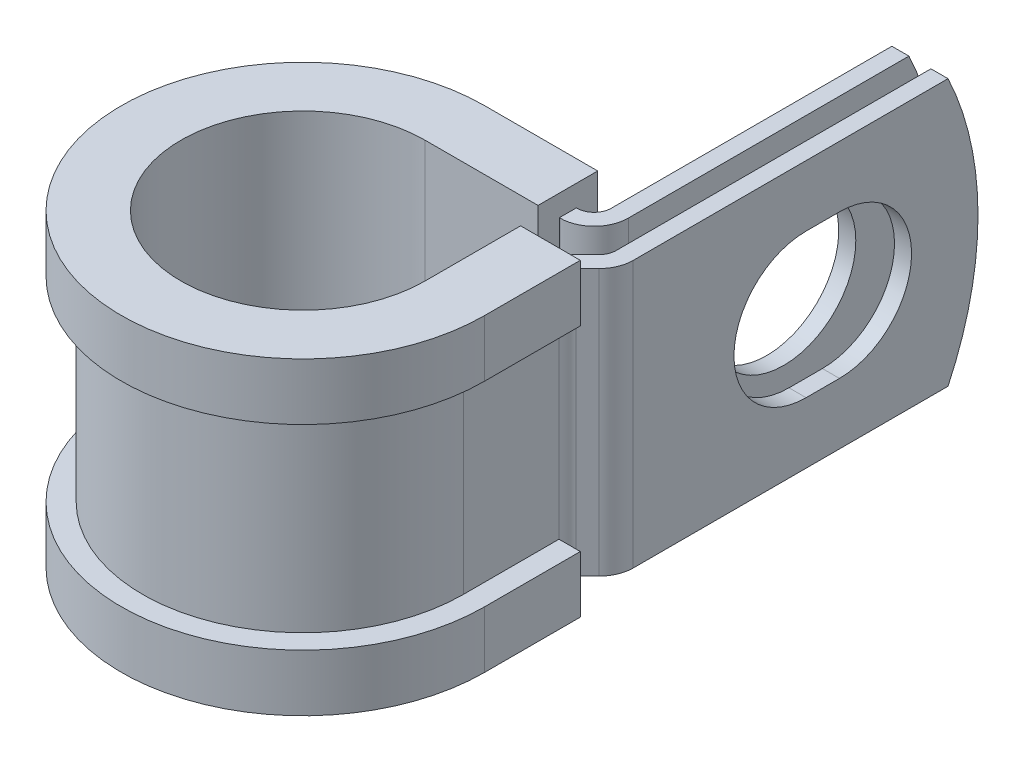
ISO-10303-21;
HEADER;
FILE_DESCRIPTION(('STEP AP214'),'2;1');
FILE_NAME('part.step','',(''),(''),'','','');
FILE_SCHEMA(('AUTOMOTIVE_DESIGN { 1 0 10303 214 1 1 1 1 }'));
ENDSEC;
DATA;
#1=APPLICATION_CONTEXT('core data for automotive mechanical design processes');
#2=APPLICATION_PROTOCOL_DEFINITION('international standard','automotive_design',2000,#1);
#3=PRODUCT_CONTEXT('',#1,'mechanical');
#4=PRODUCT('Part','Part','',(#3));
#5=PRODUCT_RELATED_PRODUCT_CATEGORY('part','',(#4));
#6=PRODUCT_DEFINITION_FORMATION('','',#4);
#7=PRODUCT_DEFINITION_CONTEXT('part definition',#1,'design');
#8=PRODUCT_DEFINITION('design','',#6,#7);
#9=PRODUCT_DEFINITION_SHAPE('','',#8);
#10=(LENGTH_UNIT() NAMED_UNIT(*) SI_UNIT(.MILLI.,.METRE.));
#11=(NAMED_UNIT(*) PLANE_ANGLE_UNIT() SI_UNIT($,.RADIAN.));
#12=(NAMED_UNIT(*) SI_UNIT($,.STERADIAN.) SOLID_ANGLE_UNIT());
#13=UNCERTAINTY_MEASURE_WITH_UNIT(LENGTH_MEASURE(1.E-05),#10,'distance_accuracy_value','');
#14=(GEOMETRIC_REPRESENTATION_CONTEXT(3) GLOBAL_UNCERTAINTY_ASSIGNED_CONTEXT((#13)) GLOBAL_UNIT_ASSIGNED_CONTEXT((#10,
#11,#12)) REPRESENTATION_CONTEXT('',''));
#15=CARTESIAN_POINT('',(0.,0.,0.));
#16=DIRECTION('',(0.,0.,1.));
#17=DIRECTION('',(1.,0.,0.));
#18=AXIS2_PLACEMENT_3D('',#15,#16,#17);
#19=CARTESIAN_POINT('',(10.9271698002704,-9.525,-10.2489));
#20=DIRECTION('',(0.,1.,0.));
#21=DIRECTION('',(1.,0.,0.));
#22=AXIS2_PLACEMENT_3D('',#19,#20,#21);
#23=PLANE('',#22);
#24=DIRECTION('',(0.,0.,-1.));
#25=VECTOR('',#24,1.);
#26=CARTESIAN_POINT('',(8.08236980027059,-9.525,-10.2489));
#27=LINE('',#26,#25);
#28=CARTESIAN_POINT('',(8.08236980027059,-9.525,-10.2489));
#29=VERTEX_POINT('',#28);
#30=CARTESIAN_POINT('',(8.08236980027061,-9.525,-11.4681));
#31=VERTEX_POINT('',#30);
#32=EDGE_CURVE('E524',#29,#31,#27,.T.);
#33=ORIENTED_EDGE('',*,*,#32,.T.);
#34=DIRECTION('',(1.,0.,0.));
#35=VECTOR('',#34,1.);
#36=CARTESIAN_POINT('',(0.,-9.525,-11.4681));
#37=LINE('',#36,#35);
#38=CARTESIAN_POINT('',(8.13316980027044,-9.525,-11.4681));
#39=VERTEX_POINT('',#38);
#40=EDGE_CURVE('E411',#39,#31,#37,.F.);
#41=ORIENTED_EDGE('',*,*,#40,.F.);
#42=CARTESIAN_POINT('',(8.13316980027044,-9.525,-12.6873));
#43=DIRECTION('',(0.,1.,0.));
#44=DIRECTION('',(1.,0.,0.));
#45=AXIS2_PLACEMENT_3D('',#42,#43,#44);
#46=CIRCLE('',#45,1.2192);
#47=CARTESIAN_POINT('',(9.35236980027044,-9.525,-12.6873));
#48=VERTEX_POINT('',#47);
#49=EDGE_CURVE('E409',#48,#39,#46,.F.);
#50=ORIENTED_EDGE('',*,*,#49,.F.);
#51=DIRECTION('',(0.,0.,1.));
#52=VECTOR('',#51,1.);
#53=CARTESIAN_POINT('',(9.35236980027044,-9.525,-34.8996));
#54=LINE('',#53,#52);
#55=CARTESIAN_POINT('',(9.35236980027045,-9.525,-32.7550631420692));
#56=VERTEX_POINT('',#55);
#57=EDGE_CURVE('E407',#56,#48,#54,.T.);
#58=ORIENTED_EDGE('',*,*,#57,.F.);
#59=DIRECTION('',(-1.,0.,0.));
#60=VECTOR('',#59,1.);
#61=CARTESIAN_POINT('',(13.3655698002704,-9.525,-32.7550631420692));
#62=LINE('',#61,#60);
#63=CARTESIAN_POINT('',(10.5715698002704,-9.525,-32.7550631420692));
#64=VERTEX_POINT('',#63);
#65=EDGE_CURVE('E12',#64,#56,#62,.T.);
#66=ORIENTED_EDGE('',*,*,#65,.F.);
#67=DIRECTION('',(0.,0.,1.));
#68=VECTOR('',#67,1.);
#69=CARTESIAN_POINT('',(10.5715698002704,-9.525,-34.8996));
#70=LINE('',#69,#68);
#71=CARTESIAN_POINT('',(10.5715698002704,-9.525,-12.6873));
#72=VERTEX_POINT('',#71);
#73=EDGE_CURVE('E405',#64,#72,#70,.T.);
#74=ORIENTED_EDGE('',*,*,#73,.T.);
#75=CARTESIAN_POINT('',(8.13316980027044,-9.525,-12.6873));
#76=DIRECTION('',(0.,-1.,0.));
#77=DIRECTION('',(0.,0.,1.));
#78=AXIS2_PLACEMENT_3D('',#75,#76,#77);
#79=CIRCLE('',#78,2.4384);
#80=CARTESIAN_POINT('',(8.13316980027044,-9.525,-10.2489));
#81=VERTEX_POINT('',#80);
#82=EDGE_CURVE('E402',#72,#81,#79,.T.);
#83=ORIENTED_EDGE('',*,*,#82,.T.);
#84=DIRECTION('',(-1.,0.,0.));
#85=VECTOR('',#84,1.);
#86=CARTESIAN_POINT('',(0.,-9.525,-10.2489));
#87=LINE('',#86,#85);
#88=EDGE_CURVE('E399',#81,#29,#87,.T.);
#89=ORIENTED_EDGE('',*,*,#88,.T.);
#90=EDGE_LOOP('',(#33,#41,#50,#58,#66,#74,#83,#89));
#91=FACE_BOUND('',#90,.T.);
#92=ADVANCED_FACE('F55',(#91),#23,.F.);
#93=CARTESIAN_POINT('',(10.9271698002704,9.525,-10.2489));
#94=DIRECTION('',(0.,1.,0.));
#95=DIRECTION('',(1.,0.,0.));
#96=AXIS2_PLACEMENT_3D('',#93,#94,#95);
#97=PLANE('',#96);
#98=DIRECTION('',(1.,0.,0.));
#99=VECTOR('',#98,1.);
#100=CARTESIAN_POINT('',(0.,9.525,-11.4681));
#101=LINE('',#100,#99);
#102=CARTESIAN_POINT('',(8.13316980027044,9.525,-11.4681));
#103=VERTEX_POINT('',#102);
#104=CARTESIAN_POINT('',(8.08236980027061,9.525,-11.4681));
#105=VERTEX_POINT('',#104);
#106=EDGE_CURVE('E369',#103,#105,#101,.F.);
#107=ORIENTED_EDGE('',*,*,#106,.T.);
#108=DIRECTION('',(0.,0.,1.));
#109=VECTOR('',#108,1.);
#110=CARTESIAN_POINT('',(8.08236980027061,9.525,-11.4681));
#111=LINE('',#110,#109);
#112=CARTESIAN_POINT('',(8.08236980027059,9.525,-10.2489));
#113=VERTEX_POINT('',#112);
#114=EDGE_CURVE('E518',#105,#113,#111,.T.);
#115=ORIENTED_EDGE('',*,*,#114,.T.);
#116=DIRECTION('',(-1.,0.,0.));
#117=VECTOR('',#116,1.);
#118=CARTESIAN_POINT('',(0.,9.525,-10.2489));
#119=LINE('',#118,#117);
#120=CARTESIAN_POINT('',(8.13316980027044,9.525,-10.2489));
#121=VERTEX_POINT('',#120);
#122=EDGE_CURVE('E626',#121,#113,#119,.T.);
#123=ORIENTED_EDGE('',*,*,#122,.F.);
#124=CARTESIAN_POINT('',(8.13316980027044,9.525,-12.6873));
#125=DIRECTION('',(0.,-1.,0.));
#126=DIRECTION('',(0.,0.,1.));
#127=AXIS2_PLACEMENT_3D('',#124,#125,#126);
#128=CIRCLE('',#127,2.4384);
#129=CARTESIAN_POINT('',(10.5715698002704,9.525,-12.6873));
#130=VERTEX_POINT('',#129);
#131=EDGE_CURVE('E371',#130,#121,#128,.T.);
#132=ORIENTED_EDGE('',*,*,#131,.F.);
#133=DIRECTION('',(0.,0.,1.));
#134=VECTOR('',#133,1.);
#135=CARTESIAN_POINT('',(10.5715698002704,9.525,-34.8996));
#136=LINE('',#135,#134);
#137=CARTESIAN_POINT('',(10.5715698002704,9.525,-32.7550631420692));
#138=VERTEX_POINT('',#137);
#139=EDGE_CURVE('E362',#138,#130,#136,.T.);
#140=ORIENTED_EDGE('',*,*,#139,.F.);
#141=DIRECTION('',(-1.,0.,0.));
#142=VECTOR('',#141,1.);
#143=CARTESIAN_POINT('',(13.3655698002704,9.525,-32.7550631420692));
#144=LINE('',#143,#142);
#145=CARTESIAN_POINT('',(9.35236980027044,9.525,-32.7550631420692));
#146=VERTEX_POINT('',#145);
#147=EDGE_CURVE('E63',#138,#146,#144,.T.);
#148=ORIENTED_EDGE('',*,*,#147,.T.);
#149=DIRECTION('',(0.,0.,1.));
#150=VECTOR('',#149,1.);
#151=CARTESIAN_POINT('',(9.35236980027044,9.525,-34.8996));
#152=LINE('',#151,#150);
#153=CARTESIAN_POINT('',(9.35236980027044,9.525,-12.6873));
#154=VERTEX_POINT('',#153);
#155=EDGE_CURVE('E359',#146,#154,#152,.T.);
#156=ORIENTED_EDGE('',*,*,#155,.T.);
#157=CARTESIAN_POINT('',(8.13316980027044,9.525,-12.6873));
#158=DIRECTION('',(0.,1.,0.));
#159=DIRECTION('',(1.,0.,0.));
#160=AXIS2_PLACEMENT_3D('',#157,#158,#159);
#161=CIRCLE('',#160,1.2192);
#162=EDGE_CURVE('E367',#154,#103,#161,.F.);
#163=ORIENTED_EDGE('',*,*,#162,.T.);
#164=EDGE_LOOP('',(#107,#115,#123,#132,#140,#148,#156,#163));
#165=FACE_BOUND('',#164,.T.);
#166=ADVANCED_FACE('F358',(#165),#97,.T.);
#167=CARTESIAN_POINT('',(0.,9.525,-10.2489));
#168=DIRECTION('',(0.,0.,1.));
#169=DIRECTION('',(1.,0.,0.));
#170=AXIS2_PLACEMENT_3D('',#167,#168,#169);
#171=PLANE('',#170);
#172=ORIENTED_EDGE('',*,*,#122,.T.);
#173=DIRECTION('',(0.,-1.,0.));
#174=VECTOR('',#173,1.);
#175=CARTESIAN_POINT('',(8.08236980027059,9.525,-10.2489));
#176=LINE('',#175,#174);
#177=EDGE_CURVE('E521',#113,#29,#176,.T.);
#178=ORIENTED_EDGE('',*,*,#177,.T.);
#179=ORIENTED_EDGE('',*,*,#88,.F.);
#180=DIRECTION('',(0.,-1.,0.));
#181=VECTOR('',#180,1.);
#182=CARTESIAN_POINT('',(8.13316980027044,9.525,-10.2489));
#183=LINE('',#182,#181);
#184=EDGE_CURVE('E345',#121,#81,#183,.T.);
#185=ORIENTED_EDGE('',*,*,#184,.F.);
#186=EDGE_LOOP('',(#172,#178,#179,#185));
#187=FACE_BOUND('',#186,.T.);
#188=ADVANCED_FACE('F636',(#187),#171,.T.);
#189=CARTESIAN_POINT('',(13.3655698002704,9.525,-10.2489));
#190=DIRECTION('',(-1.,0.,0.));
#191=DIRECTION('',(0.,0.,1.));
#192=AXIS2_PLACEMENT_3D('',#189,#190,#191);
#193=PLANE('',#192);
#194=CARTESIAN_POINT('',(13.3655698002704,0.,-24.9935999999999));
#195=DIRECTION('',(1.,0.,0.));
#196=DIRECTION('',(0.,0.,-1.));
#197=AXIS2_PLACEMENT_3D('',#194,#195,#196);
#198=CIRCLE('',#197,5.1562);
#199=CARTESIAN_POINT('',(13.3655698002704,-5.1562,-24.9936000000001));
#200=VERTEX_POINT('',#199);
#201=CARTESIAN_POINT('',(13.3655698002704,5.1562,-24.9936000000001));
#202=VERTEX_POINT('',#201);
#203=EDGE_CURVE('E581',#200,#202,#198,.T.);
#204=ORIENTED_EDGE('',*,*,#203,.F.);
#205=DIRECTION('',(0.,0.,-1.));
#206=VECTOR('',#205,1.);
#207=CARTESIAN_POINT('',(13.3655698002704,-5.1562,-22.6059999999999));
#208=LINE('',#207,#206);
#209=CARTESIAN_POINT('',(13.3655698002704,-5.1562,-22.6059999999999));
#210=VERTEX_POINT('',#209);
#211=EDGE_CURVE('E584',#210,#200,#208,.T.);
#212=ORIENTED_EDGE('',*,*,#211,.F.);
#213=CARTESIAN_POINT('',(13.3655698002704,0.,-22.6059999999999));
#214=DIRECTION('',(1.,0.,0.));
#215=DIRECTION('',(0.,0.,-1.));
#216=AXIS2_PLACEMENT_3D('',#213,#214,#215);
#217=CIRCLE('',#216,5.1562);
#218=CARTESIAN_POINT('',(13.3655698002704,5.1562,-22.6059999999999));
#219=VERTEX_POINT('',#218);
#220=EDGE_CURVE('E577',#219,#210,#217,.T.);
#221=ORIENTED_EDGE('',*,*,#220,.F.);
#222=DIRECTION('',(0.,0.,1.));
#223=VECTOR('',#222,1.);
#224=CARTESIAN_POINT('',(13.3655698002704,5.1562,-22.6059999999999));
#225=LINE('',#224,#223);
#226=EDGE_CURVE('E578',#202,#219,#225,.T.);
#227=ORIENTED_EDGE('',*,*,#226,.F.);
#228=EDGE_LOOP('',(#204,#212,#221,#227));
#229=FACE_BOUND('',#228,.T.);
#230=DIRECTION('',(0.,0.,-1.));
#231=VECTOR('',#230,1.);
#232=CARTESIAN_POINT('',(13.3655698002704,-9.525,-10.2489));
#233=LINE('',#232,#231);
#234=CARTESIAN_POINT('',(13.3655698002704,-9.525,-10.2489));
#235=VERTEX_POINT('',#234);
#236=CARTESIAN_POINT('',(13.3655698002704,-9.525,-32.7550631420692));
#237=VERTEX_POINT('',#236);
#238=EDGE_CURVE('E383',#235,#237,#233,.T.);
#239=ORIENTED_EDGE('',*,*,#238,.T.);
#240=CARTESIAN_POINT('',(13.3655698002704,0.,-12.6746));
#241=DIRECTION('',(-1.,0.,0.));
#242=DIRECTION('',(0.,0.,1.));
#243=AXIS2_PLACEMENT_3D('',#240,#241,#242);
#244=CIRCLE('',#243,22.225);
#245=CARTESIAN_POINT('',(13.3655698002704,9.525,-32.7550631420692));
#246=VERTEX_POINT('',#245);
#247=EDGE_CURVE('E569',#246,#237,#244,.T.);
#248=ORIENTED_EDGE('',*,*,#247,.F.);
#249=DIRECTION('',(0.,0.,-1.));
#250=VECTOR('',#249,1.);
#251=CARTESIAN_POINT('',(13.3655698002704,9.525,-10.2489));
#252=LINE('',#251,#250);
#253=CARTESIAN_POINT('',(13.3655698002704,9.525,-10.2489));
#254=VERTEX_POINT('',#253);
#255=EDGE_CURVE('E420',#254,#246,#252,.T.);
#256=ORIENTED_EDGE('',*,*,#255,.F.);
#257=DIRECTION('',(0.,-1.,0.));
#258=VECTOR('',#257,1.);
#259=CARTESIAN_POINT('',(13.3655698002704,9.525,-10.2489));
#260=LINE('',#259,#258);
#261=EDGE_CURVE('E382',#254,#235,#260,.T.);
#262=ORIENTED_EDGE('',*,*,#261,.T.);
#263=EDGE_LOOP('',(#239,#248,#256,#262));
#264=FACE_BOUND('',#263,.T.);
#265=ADVANCED_FACE('F57',(#229,#264),#193,.F.);
#266=CARTESIAN_POINT('',(12.1463698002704,9.525,-10.2489));
#267=DIRECTION('',(-1.,0.,0.));
#268=DIRECTION('',(0.,0.,1.));
#269=AXIS2_PLACEMENT_3D('',#266,#267,#268);
#270=PLANE('',#269);
#271=DIRECTION('',(0.,0.,-1.));
#272=VECTOR('',#271,1.);
#273=CARTESIAN_POINT('',(12.1463698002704,-5.1562,-22.6059999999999));
#274=LINE('',#273,#272);
#275=CARTESIAN_POINT('',(12.1463698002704,-5.1562,-22.6059999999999));
#276=VERTEX_POINT('',#275);
#277=CARTESIAN_POINT('',(12.1463698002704,-5.1562,-24.9936000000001));
#278=VERTEX_POINT('',#277);
#279=EDGE_CURVE('E580',#276,#278,#274,.T.);
#280=ORIENTED_EDGE('',*,*,#279,.T.);
#281=CARTESIAN_POINT('',(12.1463698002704,0.,-24.9935999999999));
#282=DIRECTION('',(-1.,0.,0.));
#283=DIRECTION('',(0.,0.,1.));
#284=AXIS2_PLACEMENT_3D('',#281,#282,#283);
#285=CIRCLE('',#284,5.1562);
#286=CARTESIAN_POINT('',(12.1463698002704,5.1562,-24.9936000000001));
#287=VERTEX_POINT('',#286);
#288=EDGE_CURVE('E601',#278,#287,#285,.F.);
#289=ORIENTED_EDGE('',*,*,#288,.T.);
#290=DIRECTION('',(0.,0.,1.));
#291=VECTOR('',#290,1.);
#292=CARTESIAN_POINT('',(12.1463698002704,5.1562,-22.6059999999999));
#293=LINE('',#292,#291);
#294=CARTESIAN_POINT('',(12.1463698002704,5.1562,-22.6059999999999));
#295=VERTEX_POINT('',#294);
#296=EDGE_CURVE('E597',#287,#295,#293,.T.);
#297=ORIENTED_EDGE('',*,*,#296,.T.);
#298=CARTESIAN_POINT('',(12.1463698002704,0.,-22.6059999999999));
#299=DIRECTION('',(-1.,0.,0.));
#300=DIRECTION('',(0.,0.,1.));
#301=AXIS2_PLACEMENT_3D('',#298,#299,#300);
#302=CIRCLE('',#301,5.1562);
#303=EDGE_CURVE('E592',#295,#276,#302,.F.);
#304=ORIENTED_EDGE('',*,*,#303,.T.);
#305=EDGE_LOOP('',(#280,#289,#297,#304));
#306=FACE_BOUND('',#305,.T.);
#307=CARTESIAN_POINT('',(12.1463698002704,0.,-12.6746));
#308=DIRECTION('',(-1.,0.,0.));
#309=DIRECTION('',(0.,0.,1.));
#310=AXIS2_PLACEMENT_3D('',#307,#308,#309);
#311=CIRCLE('',#310,22.225);
#312=CARTESIAN_POINT('',(12.1463698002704,9.525,-32.7550631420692));
#313=VERTEX_POINT('',#312);
#314=CARTESIAN_POINT('',(12.1463698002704,-9.525,-32.7550631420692));
#315=VERTEX_POINT('',#314);
#316=EDGE_CURVE('E77',#313,#315,#311,.T.);
#317=ORIENTED_EDGE('',*,*,#316,.T.);
#318=DIRECTION('',(0.,0.,-1.));
#319=VECTOR('',#318,1.);
#320=CARTESIAN_POINT('',(12.1463698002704,-9.525,-10.2489));
#321=LINE('',#320,#319);
#322=CARTESIAN_POINT('',(12.1463698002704,-9.525,-10.2489));
#323=VERTEX_POINT('',#322);
#324=EDGE_CURVE('E386',#323,#315,#321,.T.);
#325=ORIENTED_EDGE('',*,*,#324,.F.);
#326=DIRECTION('',(0.,-1.,0.));
#327=VECTOR('',#326,1.);
#328=CARTESIAN_POINT('',(12.1463698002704,9.525,-10.2489));
#329=LINE('',#328,#327);
#330=CARTESIAN_POINT('',(12.1463698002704,9.525,-10.2489));
#331=VERTEX_POINT('',#330);
#332=EDGE_CURVE('E353',#331,#323,#329,.T.);
#333=ORIENTED_EDGE('',*,*,#332,.F.);
#334=DIRECTION('',(0.,0.,-1.));
#335=VECTOR('',#334,1.);
#336=CARTESIAN_POINT('',(12.1463698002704,9.525,-10.2489));
#337=LINE('',#336,#335);
#338=EDGE_CURVE('E616',#331,#313,#337,.T.);
#339=ORIENTED_EDGE('',*,*,#338,.T.);
#340=EDGE_LOOP('',(#317,#325,#333,#339));
#341=FACE_BOUND('',#340,.T.);
#342=ADVANCED_FACE('F690',(#306,#341),#270,.T.);
#343=CARTESIAN_POINT('',(10.5715698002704,9.525,-34.8996));
#344=DIRECTION('',(1.,0.,0.));
#345=DIRECTION('',(0.,0.,-1.));
#346=AXIS2_PLACEMENT_3D('',#343,#344,#345);
#347=PLANE('',#346);
#348=CARTESIAN_POINT('',(10.5715698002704,0.,-23.7998));
#349=DIRECTION('',(1.,0.,0.));
#350=DIRECTION('',(0.,0.,-1.));
#351=AXIS2_PLACEMENT_3D('',#348,#349,#350);
#352=CIRCLE('',#351,5.1562);
#353=CARTESIAN_POINT('',(10.5715698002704,0.,-28.956));
#354=VERTEX_POINT('',#353);
#355=EDGE_CURVE('E387',#354,#354,#352,.F.);
#356=ORIENTED_EDGE('',*,*,#355,.T.);
#357=EDGE_LOOP('',(#356));
#358=FACE_BOUND('',#357,.T.);
#359=ORIENTED_EDGE('',*,*,#73,.F.);
#360=CARTESIAN_POINT('',(10.5715698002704,0.,-12.6746));
#361=DIRECTION('',(1.,0.,0.));
#362=DIRECTION('',(0.,0.,-1.));
#363=AXIS2_PLACEMENT_3D('',#360,#361,#362);
#364=CIRCLE('',#363,22.225);
#365=EDGE_CURVE('E574',#64,#138,#364,.T.);
#366=ORIENTED_EDGE('',*,*,#365,.T.);
#367=ORIENTED_EDGE('',*,*,#139,.T.);
#368=DIRECTION('',(0.,-1.,0.));
#369=VECTOR('',#368,1.);
#370=CARTESIAN_POINT('',(10.5715698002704,9.525,-12.6873));
#371=LINE('',#370,#369);
#372=EDGE_CURVE('E342',#130,#72,#371,.T.);
#373=ORIENTED_EDGE('',*,*,#372,.T.);
#374=EDGE_LOOP('',(#359,#366,#367,#373));
#375=FACE_BOUND('',#374,.T.);
#376=ADVANCED_FACE('F642',(#358,#375),#347,.T.);
#377=CARTESIAN_POINT('',(9.35236980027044,9.525,-34.8996));
#378=DIRECTION('',(1.,0.,0.));
#379=DIRECTION('',(0.,0.,-1.));
#380=AXIS2_PLACEMENT_3D('',#377,#378,#379);
#381=PLANE('',#380);
#382=CARTESIAN_POINT('',(9.35236980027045,0.,-23.7998));
#383=DIRECTION('',(-1.,0.,0.));
#384=DIRECTION('',(0.,0.,1.));
#385=AXIS2_PLACEMENT_3D('',#382,#383,#384);
#386=CIRCLE('',#385,5.1562);
#387=CARTESIAN_POINT('',(9.35236980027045,0.,-18.6436));
#388=VERTEX_POINT('',#387);
#389=EDGE_CURVE('E609',#388,#388,#386,.T.);
#390=ORIENTED_EDGE('',*,*,#389,.F.);
#391=EDGE_LOOP('',(#390));
#392=FACE_BOUND('',#391,.T.);
#393=CARTESIAN_POINT('',(9.35236980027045,0.,-12.6746));
#394=DIRECTION('',(-1.,0.,0.));
#395=DIRECTION('',(0.,0.,1.));
#396=AXIS2_PLACEMENT_3D('',#393,#394,#395);
#397=CIRCLE('',#396,22.225);
#398=EDGE_CURVE('E69',#146,#56,#397,.T.);
#399=ORIENTED_EDGE('',*,*,#398,.T.);
#400=ORIENTED_EDGE('',*,*,#57,.T.);
#401=DIRECTION('',(0.,-1.,0.));
#402=VECTOR('',#401,1.);
#403=CARTESIAN_POINT('',(9.35236980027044,9.525,-12.6873));
#404=LINE('',#403,#402);
#405=EDGE_CURVE('E339',#154,#48,#404,.T.);
#406=ORIENTED_EDGE('',*,*,#405,.F.);
#407=ORIENTED_EDGE('',*,*,#155,.F.);
#408=EDGE_LOOP('',(#399,#400,#406,#407));
#409=FACE_BOUND('',#408,.T.);
#410=ADVANCED_FACE('F365',(#392,#409),#381,.F.);
#411=CARTESIAN_POINT('',(12.6873,-9.525,-6.83640267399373));
#412=DIRECTION('',(0.,1.,0.));
#413=DIRECTION('',(1.,0.,0.));
#414=AXIS2_PLACEMENT_3D('',#411,#412,#413);
#415=CIRCLE('',#414,1.2192);
#416=CARTESIAN_POINT('',(11.4681,-9.525,-6.83640267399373));
#417=VERTEX_POINT('',#416);
#418=CARTESIAN_POINT('',(11.8251954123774,-9.525,-7.69850726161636));
#419=VERTEX_POINT('',#418);
#420=EDGE_CURVE('E414',#417,#419,#415,.F.);
#421=ORIENTED_EDGE('',*,*,#420,.F.);
#422=DIRECTION('',(1.,0.,0.));
#423=VECTOR('',#422,1.);
#424=CARTESIAN_POINT('',(10.2489,-9.525,-6.83640267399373));
#425=LINE('',#424,#423);
#426=CARTESIAN_POINT('',(10.2489,-9.525,-6.83640267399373));
#427=VERTEX_POINT('',#426);
#428=EDGE_CURVE('E452',#427,#417,#425,.T.);
#429=ORIENTED_EDGE('',*,*,#428,.F.);
#430=CARTESIAN_POINT('',(12.6873,-9.525,-6.83640267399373));
#431=DIRECTION('',(0.,-1.,0.));
#432=DIRECTION('',(0.,0.,1.));
#433=AXIS2_PLACEMENT_3D('',#430,#431,#432);
#434=CIRCLE('',#433,2.4384);
#435=CARTESIAN_POINT('',(10.9630908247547,-9.525,-8.560611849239));
#436=VERTEX_POINT('',#435);
#437=EDGE_CURVE('E396',#427,#436,#434,.T.);
#438=ORIENTED_EDGE('',*,*,#437,.T.);
#439=DIRECTION('',(0.707106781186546,0.,-0.707106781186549));
#440=VECTOR('',#439,1.);
#441=CARTESIAN_POINT('',(10.9630908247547,-9.525,-8.560611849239));
#442=LINE('',#441,#440);
#443=CARTESIAN_POINT('',(11.7892743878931,-9.525,-9.38679541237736));
#444=VERTEX_POINT('',#443);
#445=EDGE_CURVE('E393',#436,#444,#442,.T.);
#446=ORIENTED_EDGE('',*,*,#445,.T.);
#447=CARTESIAN_POINT('',(10.9271698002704,-9.525,-10.2489));
#448=DIRECTION('',(0.,1.,0.));
#449=DIRECTION('',(0.,0.,1.));
#450=AXIS2_PLACEMENT_3D('',#447,#448,#449);
#451=CIRCLE('',#450,1.2192);
#452=EDGE_CURVE('E390',#444,#323,#451,.T.);
#453=ORIENTED_EDGE('',*,*,#452,.T.);
#454=ORIENTED_EDGE('',*,*,#324,.T.);
#455=DIRECTION('',(-1.,0.,0.));
#456=VECTOR('',#455,1.);
#457=CARTESIAN_POINT('',(13.3655698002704,-9.525,-32.7550631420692));
#458=LINE('',#457,#456);
#459=EDGE_CURVE('E567',#237,#315,#458,.T.);
#460=ORIENTED_EDGE('',*,*,#459,.F.);
#461=ORIENTED_EDGE('',*,*,#238,.F.);
#462=CARTESIAN_POINT('',(10.9271698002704,-9.525,-10.2489));
#463=DIRECTION('',(0.,1.,0.));
#464=DIRECTION('',(1.,0.,0.));
#465=AXIS2_PLACEMENT_3D('',#462,#463,#464);
#466=CIRCLE('',#465,2.4384);
#467=CARTESIAN_POINT('',(12.6513789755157,-9.525,-8.52469082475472));
#468=VERTEX_POINT('',#467);
#469=EDGE_CURVE('E418',#468,#235,#466,.T.);
#470=ORIENTED_EDGE('',*,*,#469,.F.);
#471=DIRECTION('',(0.707106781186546,0.,-0.707106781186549));
#472=VECTOR('',#471,1.);
#473=CARTESIAN_POINT('',(11.8251954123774,-9.525,-7.69850726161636));
#474=LINE('',#473,#472);
#475=EDGE_CURVE('E416',#419,#468,#474,.T.);
#476=ORIENTED_EDGE('',*,*,#475,.F.);
#477=EDGE_LOOP('',(#421,#429,#438,#446,#453,#454,#460,#461,#470,#476));
#478=FACE_BOUND('',#477,.T.);
#479=ADVANCED_FACE('F676',(#478),#23,.F.);
#480=DIRECTION('',(-1.,0.,0.));
#481=VECTOR('',#480,1.);
#482=CARTESIAN_POINT('',(11.4681,9.525,-6.83640267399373));
#483=LINE('',#482,#481);
#484=CARTESIAN_POINT('',(11.4681,9.525,-6.83640267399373));
#485=VERTEX_POINT('',#484);
#486=CARTESIAN_POINT('',(10.2489,9.525,-6.83640267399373));
#487=VERTEX_POINT('',#486);
#488=EDGE_CURVE('E441',#485,#487,#483,.T.);
#489=ORIENTED_EDGE('',*,*,#488,.F.);
#490=CARTESIAN_POINT('',(12.6873,9.525,-6.83640267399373));
#491=DIRECTION('',(0.,1.,0.));
#492=DIRECTION('',(1.,0.,0.));
#493=AXIS2_PLACEMENT_3D('',#490,#491,#492);
#494=CIRCLE('',#493,1.2192);
#495=CARTESIAN_POINT('',(11.8251954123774,9.525,-7.69850726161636));
#496=VERTEX_POINT('',#495);
#497=EDGE_CURVE('E376',#485,#496,#494,.F.);
#498=ORIENTED_EDGE('',*,*,#497,.T.);
#499=DIRECTION('',(0.707106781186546,0.,-0.707106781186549));
#500=VECTOR('',#499,1.);
#501=CARTESIAN_POINT('',(11.8251954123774,9.525,-7.69850726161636));
#502=LINE('',#501,#500);
#503=CARTESIAN_POINT('',(12.6513789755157,9.525,-8.52469082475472));
#504=VERTEX_POINT('',#503);
#505=EDGE_CURVE('E378',#496,#504,#502,.T.);
#506=ORIENTED_EDGE('',*,*,#505,.T.);
#507=CARTESIAN_POINT('',(10.9271698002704,9.525,-10.2489));
#508=DIRECTION('',(0.,1.,0.));
#509=DIRECTION('',(1.,0.,0.));
#510=AXIS2_PLACEMENT_3D('',#507,#508,#509);
#511=CIRCLE('',#510,2.4384);
#512=EDGE_CURVE('E380',#504,#254,#511,.T.);
#513=ORIENTED_EDGE('',*,*,#512,.T.);
#514=ORIENTED_EDGE('',*,*,#255,.T.);
#515=DIRECTION('',(-1.,0.,0.));
#516=VECTOR('',#515,1.);
#517=CARTESIAN_POINT('',(13.3655698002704,9.525,-32.7550631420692));
#518=LINE('',#517,#516);
#519=EDGE_CURVE('E571',#246,#313,#518,.T.);
#520=ORIENTED_EDGE('',*,*,#519,.T.);
#521=ORIENTED_EDGE('',*,*,#338,.F.);
#522=CARTESIAN_POINT('',(10.9271698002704,9.525,-10.2489));
#523=DIRECTION('',(0.,1.,0.));
#524=DIRECTION('',(0.,0.,1.));
#525=AXIS2_PLACEMENT_3D('',#522,#523,#524);
#526=CIRCLE('',#525,1.2192);
#527=CARTESIAN_POINT('',(11.7892743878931,9.525,-9.38679541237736));
#528=VERTEX_POINT('',#527);
#529=EDGE_CURVE('E619',#528,#331,#526,.T.);
#530=ORIENTED_EDGE('',*,*,#529,.F.);
#531=DIRECTION('',(0.707106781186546,0.,-0.707106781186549));
#532=VECTOR('',#531,1.);
#533=CARTESIAN_POINT('',(10.9630908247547,9.525,-8.560611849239));
#534=LINE('',#533,#532);
#535=CARTESIAN_POINT('',(10.9630908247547,9.525,-8.560611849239));
#536=VERTEX_POINT('',#535);
#537=EDGE_CURVE('E622',#536,#528,#534,.T.);
#538=ORIENTED_EDGE('',*,*,#537,.F.);
#539=CARTESIAN_POINT('',(12.6873,9.525,-6.83640267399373));
#540=DIRECTION('',(0.,-1.,0.));
#541=DIRECTION('',(0.,0.,1.));
#542=AXIS2_PLACEMENT_3D('',#539,#540,#541);
#543=CIRCLE('',#542,2.4384);
#544=EDGE_CURVE('E451',#487,#536,#543,.T.);
#545=ORIENTED_EDGE('',*,*,#544,.F.);
#546=EDGE_LOOP('',(#489,#498,#506,#513,#514,#520,#521,#530,#538,#545));
#547=FACE_BOUND('',#546,.T.);
#548=ADVANCED_FACE('F448',(#547),#97,.T.);
#549=CARTESIAN_POINT('',(10.9271698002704,9.525,-10.2489));
#550=DIRECTION('',(0.,-1.,0.));
#551=DIRECTION('',(0.,0.,-1.));
#552=AXIS2_PLACEMENT_3D('',#549,#550,#551);
#553=CYLINDRICAL_SURFACE('',#552,1.2192);
#554=ORIENTED_EDGE('',*,*,#452,.F.);
#555=DIRECTION('',(0.,-1.,0.));
#556=VECTOR('',#555,1.);
#557=CARTESIAN_POINT('',(11.7892743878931,9.525,-9.38679541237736));
#558=LINE('',#557,#556);
#559=EDGE_CURVE('E351',#528,#444,#558,.T.);
#560=ORIENTED_EDGE('',*,*,#559,.F.);
#561=ORIENTED_EDGE('',*,*,#529,.T.);
#562=ORIENTED_EDGE('',*,*,#332,.T.);
#563=EDGE_LOOP('',(#554,#560,#561,#562));
#564=FACE_BOUND('',#563,.T.);
#565=ADVANCED_FACE('F686',(#564),#553,.F.);
#566=CARTESIAN_POINT('',(10.9630908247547,9.525,-8.560611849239));
#567=DIRECTION('',(-0.707106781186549,0.,-0.707106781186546));
#568=DIRECTION('',(-0.707106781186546,0.,0.707106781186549));
#569=AXIS2_PLACEMENT_3D('',#566,#567,#568);
#570=PLANE('',#569);
#571=ORIENTED_EDGE('',*,*,#445,.F.);
#572=DIRECTION('',(0.,-1.,0.));
#573=VECTOR('',#572,1.);
#574=CARTESIAN_POINT('',(10.9630908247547,9.525,-8.560611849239));
#575=LINE('',#574,#573);
#576=EDGE_CURVE('E349',#536,#436,#575,.T.);
#577=ORIENTED_EDGE('',*,*,#576,.F.);
#578=ORIENTED_EDGE('',*,*,#537,.T.);
#579=ORIENTED_EDGE('',*,*,#559,.T.);
#580=EDGE_LOOP('',(#571,#577,#578,#579));
#581=FACE_BOUND('',#580,.T.);
#582=ADVANCED_FACE('F681',(#581),#570,.T.);
#583=CARTESIAN_POINT('',(12.6873,9.525,-6.83640267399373));
#584=DIRECTION('',(0.,-1.,0.));
#585=DIRECTION('',(0.,0.,-1.));
#586=AXIS2_PLACEMENT_3D('',#583,#584,#585);
#587=CYLINDRICAL_SURFACE('',#586,2.4384);
#588=ORIENTED_EDGE('',*,*,#437,.F.);
#589=DIRECTION('',(0.,-1.,0.));
#590=VECTOR('',#589,1.);
#591=CARTESIAN_POINT('',(10.2489,9.525,-6.83640267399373));
#592=LINE('',#591,#590);
#593=EDGE_CURVE('E347',#487,#427,#592,.T.);
#594=ORIENTED_EDGE('',*,*,#593,.F.);
#595=ORIENTED_EDGE('',*,*,#544,.T.);
#596=ORIENTED_EDGE('',*,*,#576,.T.);
#597=EDGE_LOOP('',(#588,#594,#595,#596));
#598=FACE_BOUND('',#597,.T.);
#599=ADVANCED_FACE('F678',(#598),#587,.T.);
#600=CARTESIAN_POINT('',(8.13316980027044,9.525,-12.6873));
#601=DIRECTION('',(0.,-1.,0.));
#602=DIRECTION('',(0.,0.,-1.));
#603=AXIS2_PLACEMENT_3D('',#600,#601,#602);
#604=CYLINDRICAL_SURFACE('',#603,2.4384);
#605=ORIENTED_EDGE('',*,*,#82,.F.);
#606=ORIENTED_EDGE('',*,*,#372,.F.);
#607=ORIENTED_EDGE('',*,*,#131,.T.);
#608=ORIENTED_EDGE('',*,*,#184,.T.);
#609=EDGE_LOOP('',(#605,#606,#607,#608));
#610=FACE_BOUND('',#609,.T.);
#611=ADVANCED_FACE('F632',(#610),#604,.T.);
#612=CARTESIAN_POINT('',(8.13316980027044,9.525,-12.6873));
#613=DIRECTION('',(0.,-1.,0.));
#614=DIRECTION('',(0.,0.,-1.));
#615=AXIS2_PLACEMENT_3D('',#612,#613,#614);
#616=CYLINDRICAL_SURFACE('',#615,1.2192);
#617=ORIENTED_EDGE('',*,*,#49,.T.);
#618=DIRECTION('',(0.,-1.,0.));
#619=VECTOR('',#618,1.);
#620=CARTESIAN_POINT('',(8.13316980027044,9.525,-11.4681));
#621=LINE('',#620,#619);
#622=EDGE_CURVE('E330',#103,#39,#621,.T.);
#623=ORIENTED_EDGE('',*,*,#622,.F.);
#624=ORIENTED_EDGE('',*,*,#162,.F.);
#625=ORIENTED_EDGE('',*,*,#405,.T.);
#626=EDGE_LOOP('',(#617,#623,#624,#625));
#627=FACE_BOUND('',#626,.T.);
#628=ADVANCED_FACE('F647',(#627),#616,.F.);
#629=CARTESIAN_POINT('',(0.,9.525,-11.4681));
#630=DIRECTION('',(0.,0.,1.));
#631=DIRECTION('',(1.,0.,0.));
#632=AXIS2_PLACEMENT_3D('',#629,#630,#631);
#633=PLANE('',#632);
#634=DIRECTION('',(0.,-1.,0.));
#635=VECTOR('',#634,1.);
#636=CARTESIAN_POINT('',(0.,9.525,-11.4681));
#637=LINE('',#636,#635);
#638=CARTESIAN_POINT('',(1.60864847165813E-13,6.985,-11.4681));
#639=VERTEX_POINT('',#638);
#640=CARTESIAN_POINT('',(1.60864847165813E-13,-6.985,-11.4681));
#641=VERTEX_POINT('',#640);
#642=EDGE_CURVE('E321',#639,#641,#637,.T.);
#643=ORIENTED_EDGE('',*,*,#642,.F.);
#644=DIRECTION('',(1.,0.,0.));
#645=VECTOR('',#644,1.);
#646=CARTESIAN_POINT('',(1.60864847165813E-13,6.985,-11.4681));
#647=LINE('',#646,#645);
#648=CARTESIAN_POINT('',(8.08236980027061,6.985,-11.4681));
#649=VERTEX_POINT('',#648);
#650=EDGE_CURVE('E564',#639,#649,#647,.T.);
#651=ORIENTED_EDGE('',*,*,#650,.T.);
#652=DIRECTION('',(0.,1.,0.));
#653=VECTOR('',#652,1.);
#654=CARTESIAN_POINT('',(8.08236980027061,9.525,-11.4681));
#655=LINE('',#654,#653);
#656=EDGE_CURVE('E515',#649,#105,#655,.T.);
#657=ORIENTED_EDGE('',*,*,#656,.T.);
#658=ORIENTED_EDGE('',*,*,#106,.F.);
#659=ORIENTED_EDGE('',*,*,#622,.T.);
#660=ORIENTED_EDGE('',*,*,#40,.T.);
#661=DIRECTION('',(0.,1.,0.));
#662=VECTOR('',#661,1.);
#663=CARTESIAN_POINT('',(8.08236980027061,-9.525,-11.4681));
#664=LINE('',#663,#662);
#665=CARTESIAN_POINT('',(8.08236980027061,-6.985,-11.4681));
#666=VERTEX_POINT('',#665);
#667=EDGE_CURVE('E527',#31,#666,#664,.T.);
#668=ORIENTED_EDGE('',*,*,#667,.T.);
#669=DIRECTION('',(1.,0.,0.));
#670=VECTOR('',#669,1.);
#671=CARTESIAN_POINT('',(1.60864847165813E-13,-6.985,-11.4681));
#672=LINE('',#671,#670);
#673=EDGE_CURVE('E544',#641,#666,#672,.T.);
#674=ORIENTED_EDGE('',*,*,#673,.F.);
#675=EDGE_LOOP('',(#643,#651,#657,#658,#659,#660,#668,#674));
#676=FACE_BOUND('',#675,.T.);
#677=ADVANCED_FACE('F651',(#676),#633,.F.);
#678=CARTESIAN_POINT('',(0.,9.525,0.));
#679=DIRECTION('',(0.,-1.,0.));
#680=DIRECTION('',(0.,0.,-1.));
#681=AXIS2_PLACEMENT_3D('',#678,#679,#680);
#682=CYLINDRICAL_SURFACE('',#681,11.4681);
#683=DIRECTION('',(0.,-1.,0.));
#684=VECTOR('',#683,1.);
#685=CARTESIAN_POINT('',(11.4681,9.525,0.));
#686=LINE('',#685,#684);
#687=CARTESIAN_POINT('',(11.4681,6.985,0.));
#688=VERTEX_POINT('',#687);
#689=CARTESIAN_POINT('',(11.4681,-6.985,0.));
#690=VERTEX_POINT('',#689);
#691=EDGE_CURVE('E319',#688,#690,#686,.T.);
#692=ORIENTED_EDGE('',*,*,#691,.F.);
#693=CARTESIAN_POINT('',(0.,6.985,0.));
#694=DIRECTION('',(0.,-1.,0.));
#695=DIRECTION('',(0.,0.,-1.));
#696=AXIS2_PLACEMENT_3D('',#693,#694,#695);
#697=CIRCLE('',#696,11.4681);
#698=EDGE_CURVE('E513',#688,#639,#697,.T.);
#699=ORIENTED_EDGE('',*,*,#698,.T.);
#700=ORIENTED_EDGE('',*,*,#642,.T.);
#701=CARTESIAN_POINT('',(0.,-6.985,0.));
#702=DIRECTION('',(0.,-1.,0.));
#703=DIRECTION('',(0.,0.,-1.));
#704=AXIS2_PLACEMENT_3D('',#701,#702,#703);
#705=CIRCLE('',#704,11.4681);
#706=EDGE_CURVE('E302',#690,#641,#705,.T.);
#707=ORIENTED_EDGE('',*,*,#706,.F.);
#708=EDGE_LOOP('',(#692,#699,#700,#707));
#709=FACE_BOUND('',#708,.T.);
#710=ADVANCED_FACE('F317',(#709),#682,.T.);
#711=CARTESIAN_POINT('',(11.4681,9.525,0.));
#712=DIRECTION('',(-1.,0.,0.));
#713=DIRECTION('',(0.,0.,1.));
#714=AXIS2_PLACEMENT_3D('',#711,#712,#713);
#715=PLANE('',#714);
#716=DIRECTION('',(0.,-1.,0.));
#717=VECTOR('',#716,1.);
#718=CARTESIAN_POINT('',(11.4681,9.525,-6.83640267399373));
#719=LINE('',#718,#717);
#720=CARTESIAN_POINT('',(11.4681,6.985,-6.83640267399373));
#721=VERTEX_POINT('',#720);
#722=CARTESIAN_POINT('',(11.4681,-6.985,-6.83640267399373));
#723=VERTEX_POINT('',#722);
#724=EDGE_CURVE('E333',#721,#723,#719,.T.);
#725=ORIENTED_EDGE('',*,*,#724,.F.);
#726=DIRECTION('',(0.,0.,-1.));
#727=VECTOR('',#726,1.);
#728=CARTESIAN_POINT('',(11.4681,6.985,0.));
#729=LINE('',#728,#727);
#730=EDGE_CURVE('E327',#688,#721,#729,.T.);
#731=ORIENTED_EDGE('',*,*,#730,.F.);
#732=ORIENTED_EDGE('',*,*,#691,.T.);
#733=DIRECTION('',(0.,0.,-1.));
#734=VECTOR('',#733,1.);
#735=CARTESIAN_POINT('',(11.4681,-6.985,0.));
#736=LINE('',#735,#734);
#737=EDGE_CURVE('E298',#690,#723,#736,.T.);
#738=ORIENTED_EDGE('',*,*,#737,.T.);
#739=EDGE_LOOP('',(#725,#731,#732,#738));
#740=FACE_BOUND('',#739,.T.);
#741=ADVANCED_FACE('F326',(#740),#715,.F.);
#742=CARTESIAN_POINT('',(12.6873,9.525,-6.83640267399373));
#743=DIRECTION('',(0.,-1.,0.));
#744=DIRECTION('',(0.,0.,-1.));
#745=AXIS2_PLACEMENT_3D('',#742,#743,#744);
#746=CYLINDRICAL_SURFACE('',#745,1.2192);
#747=ORIENTED_EDGE('',*,*,#420,.T.);
#748=DIRECTION('',(0.,-1.,0.));
#749=VECTOR('',#748,1.);
#750=CARTESIAN_POINT('',(11.8251954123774,9.525,-7.69850726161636));
#751=LINE('',#750,#749);
#752=EDGE_CURVE('E425',#496,#419,#751,.T.);
#753=ORIENTED_EDGE('',*,*,#752,.F.);
#754=ORIENTED_EDGE('',*,*,#497,.F.);
#755=EDGE_CURVE('E328',#485,#721,#719,.T.);
#756=ORIENTED_EDGE('',*,*,#755,.T.);
#757=ORIENTED_EDGE('',*,*,#724,.T.);
#758=DIRECTION('',(0.,1.,0.));
#759=VECTOR('',#758,1.);
#760=CARTESIAN_POINT('',(11.4681,-9.525,-6.83640267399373));
#761=LINE('',#760,#759);
#762=EDGE_CURVE('E434',#417,#723,#761,.T.);
#763=ORIENTED_EDGE('',*,*,#762,.F.);
#764=EDGE_LOOP('',(#747,#753,#754,#756,#757,#763));
#765=FACE_BOUND('',#764,.T.);
#766=ADVANCED_FACE('F433',(#765),#746,.F.);
#767=CARTESIAN_POINT('',(11.8251954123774,9.525,-7.69850726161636));
#768=DIRECTION('',(-0.707106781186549,0.,-0.707106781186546));
#769=DIRECTION('',(-0.707106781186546,0.,0.707106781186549));
#770=AXIS2_PLACEMENT_3D('',#767,#768,#769);
#771=PLANE('',#770);
#772=ORIENTED_EDGE('',*,*,#475,.T.);
#773=DIRECTION('',(0.,-1.,0.));
#774=VECTOR('',#773,1.);
#775=CARTESIAN_POINT('',(12.6513789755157,9.525,-8.52469082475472));
#776=LINE('',#775,#774);
#777=EDGE_CURVE('E423',#504,#468,#776,.T.);
#778=ORIENTED_EDGE('',*,*,#777,.F.);
#779=ORIENTED_EDGE('',*,*,#505,.F.);
#780=ORIENTED_EDGE('',*,*,#752,.T.);
#781=EDGE_LOOP('',(#772,#778,#779,#780));
#782=FACE_BOUND('',#781,.T.);
#783=ADVANCED_FACE('F702',(#782),#771,.F.);
#784=CARTESIAN_POINT('',(10.9271698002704,9.525,-10.2489));
#785=DIRECTION('',(0.,-1.,0.));
#786=DIRECTION('',(0.,0.,-1.));
#787=AXIS2_PLACEMENT_3D('',#784,#785,#786);
#788=CYLINDRICAL_SURFACE('',#787,2.4384);
#789=ORIENTED_EDGE('',*,*,#469,.T.);
#790=ORIENTED_EDGE('',*,*,#261,.F.);
#791=ORIENTED_EDGE('',*,*,#512,.F.);
#792=ORIENTED_EDGE('',*,*,#777,.T.);
#793=EDGE_LOOP('',(#789,#790,#791,#792));
#794=FACE_BOUND('',#793,.T.);
#795=ADVANCED_FACE('F700',(#794),#788,.T.);
#796=CARTESIAN_POINT('',(25.1555057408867,0.,-23.7998));
#797=DIRECTION('',(-1.,0.,0.));
#798=DIRECTION('',(0.,0.,1.));
#799=AXIS2_PLACEMENT_3D('',#796,#797,#798);
#800=CYLINDRICAL_SURFACE('',#799,5.1562);
#801=ORIENTED_EDGE('',*,*,#389,.T.);
#802=EDGE_LOOP('',(#801));
#803=FACE_BOUND('',#802,.T.);
#804=ORIENTED_EDGE('',*,*,#355,.F.);
#805=EDGE_LOOP('',(#804));
#806=FACE_BOUND('',#805,.T.);
#807=ADVANCED_FACE('F709',(#803,#806),#800,.F.);
#808=CARTESIAN_POINT('',(-4.21320213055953,-5.1562,-22.6059999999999));
#809=DIRECTION('',(0.,-1.,0.));
#810=DIRECTION('',(0.,0.,-1.));
#811=AXIS2_PLACEMENT_3D('',#808,#809,#810);
#812=PLANE('',#811);
#813=DIRECTION('',(1.,0.,0.));
#814=VECTOR('',#813,1.);
#815=CARTESIAN_POINT('',(-4.21320213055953,-5.1562,-22.6059999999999));
#816=LINE('',#815,#814);
#817=EDGE_CURVE('E595',#276,#210,#816,.T.);
#818=ORIENTED_EDGE('',*,*,#817,.T.);
#819=ORIENTED_EDGE('',*,*,#211,.T.);
#820=DIRECTION('',(1.,0.,0.));
#821=VECTOR('',#820,1.);
#822=CARTESIAN_POINT('',(-4.21320213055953,-5.1562,-24.9936000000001));
#823=LINE('',#822,#821);
#824=EDGE_CURVE('E591',#278,#200,#823,.T.);
#825=ORIENTED_EDGE('',*,*,#824,.F.);
#826=ORIENTED_EDGE('',*,*,#279,.F.);
#827=EDGE_LOOP('',(#818,#819,#825,#826));
#828=FACE_BOUND('',#827,.T.);
#829=ADVANCED_FACE('F752',(#828),#812,.F.);
#830=CARTESIAN_POINT('',(-4.21320213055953,0.,-24.9935999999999));
#831=DIRECTION('',(1.,0.,0.));
#832=DIRECTION('',(0.,0.,-1.));
#833=AXIS2_PLACEMENT_3D('',#830,#831,#832);
#834=CYLINDRICAL_SURFACE('',#833,5.1562);
#835=ORIENTED_EDGE('',*,*,#824,.T.);
#836=ORIENTED_EDGE('',*,*,#203,.T.);
#837=DIRECTION('',(1.,0.,0.));
#838=VECTOR('',#837,1.);
#839=CARTESIAN_POINT('',(-4.21320213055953,5.1562,-24.9936000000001));
#840=LINE('',#839,#838);
#841=EDGE_CURVE('E600',#287,#202,#840,.T.);
#842=ORIENTED_EDGE('',*,*,#841,.F.);
#843=ORIENTED_EDGE('',*,*,#288,.F.);
#844=EDGE_LOOP('',(#835,#836,#842,#843));
#845=FACE_BOUND('',#844,.T.);
#846=ADVANCED_FACE('F756',(#845),#834,.F.);
#847=CARTESIAN_POINT('',(-4.21320213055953,5.1562,-22.6059999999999));
#848=DIRECTION('',(0.,1.,0.));
#849=DIRECTION('',(0.,0.,1.));
#850=AXIS2_PLACEMENT_3D('',#847,#848,#849);
#851=PLANE('',#850);
#852=ORIENTED_EDGE('',*,*,#841,.T.);
#853=ORIENTED_EDGE('',*,*,#226,.T.);
#854=DIRECTION('',(1.,0.,0.));
#855=VECTOR('',#854,1.);
#856=CARTESIAN_POINT('',(-4.21320213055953,5.1562,-22.6059999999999));
#857=LINE('',#856,#855);
#858=EDGE_CURVE('E596',#295,#219,#857,.T.);
#859=ORIENTED_EDGE('',*,*,#858,.F.);
#860=ORIENTED_EDGE('',*,*,#296,.F.);
#861=EDGE_LOOP('',(#852,#853,#859,#860));
#862=FACE_BOUND('',#861,.T.);
#863=ADVANCED_FACE('F760',(#862),#851,.F.);
#864=CARTESIAN_POINT('',(-4.21320213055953,0.,-22.6059999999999));
#865=DIRECTION('',(1.,0.,0.));
#866=DIRECTION('',(0.,0.,-1.));
#867=AXIS2_PLACEMENT_3D('',#864,#865,#866);
#868=CYLINDRICAL_SURFACE('',#867,5.1562);
#869=ORIENTED_EDGE('',*,*,#858,.T.);
#870=ORIENTED_EDGE('',*,*,#220,.T.);
#871=ORIENTED_EDGE('',*,*,#817,.F.);
#872=ORIENTED_EDGE('',*,*,#303,.F.);
#873=EDGE_LOOP('',(#869,#870,#871,#872));
#874=FACE_BOUND('',#873,.T.);
#875=ADVANCED_FACE('F764',(#874),#868,.F.);
#876=CARTESIAN_POINT('',(13.3655698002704,0.,-12.6746));
#877=DIRECTION('',(-1.,0.,0.));
#878=DIRECTION('',(0.,0.,1.));
#879=AXIS2_PLACEMENT_3D('',#876,#877,#878);
#880=CYLINDRICAL_SURFACE('',#879,22.225);
#881=ORIENTED_EDGE('',*,*,#365,.F.);
#882=ORIENTED_EDGE('',*,*,#65,.T.);
#883=ORIENTED_EDGE('',*,*,#398,.F.);
#884=ORIENTED_EDGE('',*,*,#147,.F.);
#885=EDGE_LOOP('',(#881,#882,#883,#884));
#886=FACE_BOUND('',#885,.T.);
#887=ADVANCED_FACE('F643',(#886),#880,.T.);
#888=ORIENTED_EDGE('',*,*,#519,.F.);
#889=ORIENTED_EDGE('',*,*,#247,.T.);
#890=ORIENTED_EDGE('',*,*,#459,.T.);
#891=ORIENTED_EDGE('',*,*,#316,.F.);
#892=EDGE_LOOP('',(#888,#889,#890,#891));
#893=FACE_BOUND('',#892,.T.);
#894=ADVANCED_FACE('F691',(#893),#880,.T.);
#895=CARTESIAN_POINT('',(1.82242235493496E-13,11.049,-12.9921));
#896=DIRECTION('',(0.,0.,1.));
#897=DIRECTION('',(1.,0.,0.));
#898=AXIS2_PLACEMENT_3D('',#895,#896,#897);
#899=PLANE('',#898);
#900=DIRECTION('',(0.,-1.,0.));
#901=VECTOR('',#900,1.);
#902=CARTESIAN_POINT('',(1.82242235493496E-13,11.049,-12.9921));
#903=LINE('',#902,#901);
#904=CARTESIAN_POINT('',(1.82242235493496E-13,11.049,-12.9921));
#905=VERTEX_POINT('',#904);
#906=CARTESIAN_POINT('',(1.82242235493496E-13,6.985,-12.9921));
#907=VERTEX_POINT('',#906);
#908=EDGE_CURVE('E323',#905,#907,#903,.T.);
#909=ORIENTED_EDGE('',*,*,#908,.F.);
#910=DIRECTION('',(1.,0.,0.));
#911=VECTOR('',#910,1.);
#912=CARTESIAN_POINT('',(1.82242235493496E-13,11.049,-12.9921));
#913=LINE('',#912,#911);
#914=CARTESIAN_POINT('',(8.08236980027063,11.049,-12.9921));
#915=VERTEX_POINT('',#914);
#916=EDGE_CURVE('E558',#905,#915,#913,.T.);
#917=ORIENTED_EDGE('',*,*,#916,.T.);
#918=DIRECTION('',(0.,-1.,0.));
#919=VECTOR('',#918,1.);
#920=CARTESIAN_POINT('',(8.08236980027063,11.049,-12.9921));
#921=LINE('',#920,#919);
#922=CARTESIAN_POINT('',(8.08236980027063,6.985,-12.9921));
#923=VERTEX_POINT('',#922);
#924=EDGE_CURVE('E540',#915,#923,#921,.T.);
#925=ORIENTED_EDGE('',*,*,#924,.T.);
#926=DIRECTION('',(1.,0.,0.));
#927=VECTOR('',#926,1.);
#928=CARTESIAN_POINT('',(1.82242235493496E-13,6.985,-12.9921));
#929=LINE('',#928,#927);
#930=EDGE_CURVE('E561',#907,#923,#929,.T.);
#931=ORIENTED_EDGE('',*,*,#930,.F.);
#932=EDGE_LOOP('',(#909,#917,#925,#931));
#933=FACE_BOUND('',#932,.T.);
#934=ADVANCED_FACE('F855',(#933),#899,.F.);
#935=CARTESIAN_POINT('',(1.22385548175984E-13,11.049,-8.7249));
#936=DIRECTION('',(0.,0.,-1.));
#937=DIRECTION('',(0.,1.,0.));
#938=AXIS2_PLACEMENT_3D('',#935,#936,#937);
#939=PLANE('',#938);
#940=DIRECTION('',(0.,1.,0.));
#941=VECTOR('',#940,1.);
#942=CARTESIAN_POINT('',(1.22385548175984E-13,11.049,-8.7249));
#943=LINE('',#942,#941);
#944=CARTESIAN_POINT('',(1.22385548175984E-13,-11.049,-8.7249));
#945=VERTEX_POINT('',#944);
#946=CARTESIAN_POINT('',(1.22385548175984E-13,11.049,-8.7249));
#947=VERTEX_POINT('',#946);
#948=EDGE_CURVE('E491',#945,#947,#943,.T.);
#949=ORIENTED_EDGE('',*,*,#948,.F.);
#950=DIRECTION('',(1.,0.,0.));
#951=VECTOR('',#950,1.);
#952=CARTESIAN_POINT('',(1.22385548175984E-13,-11.049,-8.7249));
#953=LINE('',#952,#951);
#954=CARTESIAN_POINT('',(8.08236980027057,-11.049,-8.7249));
#955=VERTEX_POINT('',#954);
#956=EDGE_CURVE('E552',#945,#955,#953,.T.);
#957=ORIENTED_EDGE('',*,*,#956,.T.);
#958=DIRECTION('',(0.,1.,0.));
#959=VECTOR('',#958,1.);
#960=CARTESIAN_POINT('',(8.08236980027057,11.049,-8.7249));
#961=LINE('',#960,#959);
#962=CARTESIAN_POINT('',(8.08236980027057,11.049,-8.7249));
#963=VERTEX_POINT('',#962);
#964=EDGE_CURVE('E536',#955,#963,#961,.T.);
#965=ORIENTED_EDGE('',*,*,#964,.T.);
#966=DIRECTION('',(1.,0.,0.));
#967=VECTOR('',#966,1.);
#968=CARTESIAN_POINT('',(1.22385548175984E-13,11.049,-8.7249));
#969=LINE('',#968,#967);
#970=EDGE_CURVE('E555',#947,#963,#969,.T.);
#971=ORIENTED_EDGE('',*,*,#970,.F.);
#972=EDGE_LOOP('',(#949,#957,#965,#971));
#973=FACE_BOUND('',#972,.T.);
#974=ADVANCED_FACE('F941',(#973),#939,.F.);
#975=CARTESIAN_POINT('',(1.82242235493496E-13,-11.049,-12.9921));
#976=DIRECTION('',(0.,0.,1.));
#977=DIRECTION('',(1.,0.,0.));
#978=AXIS2_PLACEMENT_3D('',#975,#976,#977);
#979=PLANE('',#978);
#980=DIRECTION('',(0.,-1.,0.));
#981=VECTOR('',#980,1.);
#982=CARTESIAN_POINT('',(1.82242235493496E-13,-11.049,-12.9921));
#983=LINE('',#982,#981);
#984=CARTESIAN_POINT('',(1.82242235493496E-13,-6.985,-12.9921));
#985=VERTEX_POINT('',#984);
#986=CARTESIAN_POINT('',(1.82242235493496E-13,-11.049,-12.9921));
#987=VERTEX_POINT('',#986);
#988=EDGE_CURVE('E477',#985,#987,#983,.T.);
#989=ORIENTED_EDGE('',*,*,#988,.F.);
#990=DIRECTION('',(1.,0.,0.));
#991=VECTOR('',#990,1.);
#992=CARTESIAN_POINT('',(1.82242235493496E-13,-6.985,-12.9921));
#993=LINE('',#992,#991);
#994=CARTESIAN_POINT('',(8.08236980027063,-6.985,-12.9921));
#995=VERTEX_POINT('',#994);
#996=EDGE_CURVE('E546',#985,#995,#993,.T.);
#997=ORIENTED_EDGE('',*,*,#996,.T.);
#998=DIRECTION('',(0.,-1.,0.));
#999=VECTOR('',#998,1.);
#1000=CARTESIAN_POINT('',(8.08236980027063,-11.049,-12.9921));
#1001=LINE('',#1000,#999);
#1002=CARTESIAN_POINT('',(8.08236980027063,-11.049,-12.9921));
#1003=VERTEX_POINT('',#1002);
#1004=EDGE_CURVE('E532',#995,#1003,#1001,.T.);
#1005=ORIENTED_EDGE('',*,*,#1004,.T.);
#1006=DIRECTION('',(1.,0.,0.));
#1007=VECTOR('',#1006,1.);
#1008=CARTESIAN_POINT('',(1.82242235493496E-13,-11.049,-12.9921));
#1009=LINE('',#1008,#1007);
#1010=EDGE_CURVE('E549',#987,#1003,#1009,.T.);
#1011=ORIENTED_EDGE('',*,*,#1010,.F.);
#1012=EDGE_LOOP('',(#989,#997,#1005,#1011));
#1013=FACE_BOUND('',#1012,.T.);
#1014=ADVANCED_FACE('F662',(#1013),#979,.F.);
#1015=CARTESIAN_POINT('',(0.,9.525,0.));
#1016=DIRECTION('',(0.,-1.,0.));
#1017=DIRECTION('',(0.,0.,-1.));
#1018=AXIS2_PLACEMENT_3D('',#1015,#1016,#1017);
#1019=CYLINDRICAL_SURFACE('',#1018,12.9921);
#1020=DIRECTION('',(0.,-1.,0.));
#1021=VECTOR('',#1020,1.);
#1022=CARTESIAN_POINT('',(12.9921,11.049,0.));
#1023=LINE('',#1022,#1021);
#1024=CARTESIAN_POINT('',(12.9921,11.049,0.));
#1025=VERTEX_POINT('',#1024);
#1026=CARTESIAN_POINT('',(12.9921,6.985,0.));
#1027=VERTEX_POINT('',#1026);
#1028=EDGE_CURVE('E312',#1025,#1027,#1023,.T.);
#1029=ORIENTED_EDGE('',*,*,#1028,.F.);
#1030=CARTESIAN_POINT('',(0.,11.049,0.));
#1031=DIRECTION('',(0.,-1.,0.));
#1032=DIRECTION('',(0.,0.,-1.));
#1033=AXIS2_PLACEMENT_3D('',#1030,#1031,#1032);
#1034=CIRCLE('',#1033,12.9921);
#1035=EDGE_CURVE('E507',#1025,#905,#1034,.T.);
#1036=ORIENTED_EDGE('',*,*,#1035,.T.);
#1037=ORIENTED_EDGE('',*,*,#908,.T.);
#1038=CARTESIAN_POINT('',(0.,6.985,0.));
#1039=DIRECTION('',(0.,-1.,0.));
#1040=DIRECTION('',(0.,0.,-1.));
#1041=AXIS2_PLACEMENT_3D('',#1038,#1039,#1040);
#1042=CIRCLE('',#1041,12.9921);
#1043=EDGE_CURVE('E510',#1027,#907,#1042,.T.);
#1044=ORIENTED_EDGE('',*,*,#1043,.F.);
#1045=EDGE_LOOP('',(#1029,#1036,#1037,#1044));
#1046=FACE_BOUND('',#1045,.T.);
#1047=ADVANCED_FACE('F961',(#1046),#1019,.T.);
#1048=CARTESIAN_POINT('',(0.,9.525,0.));
#1049=DIRECTION('',(0.,-1.,0.));
#1050=DIRECTION('',(0.,0.,-1.));
#1051=AXIS2_PLACEMENT_3D('',#1048,#1049,#1050);
#1052=CYLINDRICAL_SURFACE('',#1051,8.7249);
#1053=DIRECTION('',(0.,1.,0.));
#1054=VECTOR('',#1053,1.);
#1055=CARTESIAN_POINT('',(8.7249,11.049,0.));
#1056=LINE('',#1055,#1054);
#1057=CARTESIAN_POINT('',(8.7249,-11.049,0.));
#1058=VERTEX_POINT('',#1057);
#1059=CARTESIAN_POINT('',(8.7249,11.049,0.));
#1060=VERTEX_POINT('',#1059);
#1061=EDGE_CURVE('E1124',#1058,#1060,#1056,.T.);
#1062=ORIENTED_EDGE('',*,*,#1061,.F.);
#1063=CARTESIAN_POINT('',(0.,-11.049,0.));
#1064=DIRECTION('',(0.,-1.,0.));
#1065=DIRECTION('',(0.,0.,-1.));
#1066=AXIS2_PLACEMENT_3D('',#1063,#1064,#1065);
#1067=CIRCLE('',#1066,8.7249);
#1068=EDGE_CURVE('E501',#1058,#945,#1067,.T.);
#1069=ORIENTED_EDGE('',*,*,#1068,.T.);
#1070=ORIENTED_EDGE('',*,*,#948,.T.);
#1071=CARTESIAN_POINT('',(0.,11.049,0.));
#1072=DIRECTION('',(0.,-1.,0.));
#1073=DIRECTION('',(0.,0.,-1.));
#1074=AXIS2_PLACEMENT_3D('',#1071,#1072,#1073);
#1075=CIRCLE('',#1074,8.7249);
#1076=EDGE_CURVE('E504',#1060,#947,#1075,.T.);
#1077=ORIENTED_EDGE('',*,*,#1076,.F.);
#1078=EDGE_LOOP('',(#1062,#1069,#1070,#1077));
#1079=FACE_BOUND('',#1078,.T.);
#1080=ADVANCED_FACE('F971',(#1079),#1052,.F.);
#1081=CARTESIAN_POINT('',(0.,9.525,0.));
#1082=DIRECTION('',(0.,-1.,0.));
#1083=DIRECTION('',(0.,0.,-1.));
#1084=AXIS2_PLACEMENT_3D('',#1081,#1082,#1083);
#1085=CYLINDRICAL_SURFACE('',#1084,12.9921);
#1086=DIRECTION('',(0.,-1.,0.));
#1087=VECTOR('',#1086,1.);
#1088=CARTESIAN_POINT('',(12.9921,-11.049,0.));
#1089=LINE('',#1088,#1087);
#1090=CARTESIAN_POINT('',(12.9921,-6.985,0.));
#1091=VERTEX_POINT('',#1090);
#1092=CARTESIAN_POINT('',(12.9921,-11.049,0.));
#1093=VERTEX_POINT('',#1092);
#1094=EDGE_CURVE('E475',#1091,#1093,#1089,.T.);
#1095=ORIENTED_EDGE('',*,*,#1094,.F.);
#1096=CARTESIAN_POINT('',(0.,-6.985,0.));
#1097=DIRECTION('',(0.,-1.,0.));
#1098=DIRECTION('',(0.,0.,-1.));
#1099=AXIS2_PLACEMENT_3D('',#1096,#1097,#1098);
#1100=CIRCLE('',#1099,12.9921);
#1101=EDGE_CURVE('E322',#1091,#985,#1100,.T.);
#1102=ORIENTED_EDGE('',*,*,#1101,.T.);
#1103=ORIENTED_EDGE('',*,*,#988,.T.);
#1104=CARTESIAN_POINT('',(0.,-11.049,0.));
#1105=DIRECTION('',(0.,-1.,0.));
#1106=DIRECTION('',(0.,0.,-1.));
#1107=AXIS2_PLACEMENT_3D('',#1104,#1105,#1106);
#1108=CIRCLE('',#1107,12.9921);
#1109=EDGE_CURVE('E498',#1093,#987,#1108,.T.);
#1110=ORIENTED_EDGE('',*,*,#1109,.F.);
#1111=EDGE_LOOP('',(#1095,#1102,#1103,#1110));
#1112=FACE_BOUND('',#1111,.T.);
#1113=ADVANCED_FACE('F665',(#1112),#1085,.T.);
#1114=CARTESIAN_POINT('',(12.9921,6.985,0.));
#1115=DIRECTION('',(0.,-1.,0.));
#1116=DIRECTION('',(0.,0.,-1.));
#1117=AXIS2_PLACEMENT_3D('',#1114,#1115,#1116);
#1118=PLANE('',#1117);
#1119=DIRECTION('',(-1.,0.,0.));
#1120=VECTOR('',#1119,1.);
#1121=CARTESIAN_POINT('',(12.9921,6.985,-6.83640267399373));
#1122=LINE('',#1121,#1120);
#1123=CARTESIAN_POINT('',(12.9921,6.985,-6.83640267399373));
#1124=VERTEX_POINT('',#1123);
#1125=EDGE_CURVE('E445',#1124,#721,#1122,.T.);
#1126=ORIENTED_EDGE('',*,*,#1125,.F.);
#1127=DIRECTION('',(0.,0.,-1.));
#1128=VECTOR('',#1127,1.);
#1129=CARTESIAN_POINT('',(12.9921,6.985,0.));
#1130=LINE('',#1129,#1128);
#1131=EDGE_CURVE('E478',#1027,#1124,#1130,.T.);
#1132=ORIENTED_EDGE('',*,*,#1131,.F.);
#1133=ORIENTED_EDGE('',*,*,#1043,.T.);
#1134=ORIENTED_EDGE('',*,*,#930,.T.);
#1135=DIRECTION('',(0.,0.,1.));
#1136=VECTOR('',#1135,1.);
#1137=CARTESIAN_POINT('',(8.08236980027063,6.985,-12.9921));
#1138=LINE('',#1137,#1136);
#1139=EDGE_CURVE('E542',#923,#649,#1138,.T.);
#1140=ORIENTED_EDGE('',*,*,#1139,.T.);
#1141=ORIENTED_EDGE('',*,*,#650,.F.);
#1142=ORIENTED_EDGE('',*,*,#698,.F.);
#1143=ORIENTED_EDGE('',*,*,#730,.T.);
#1144=EDGE_LOOP('',(#1126,#1132,#1133,#1134,#1140,#1141,#1142,#1143));
#1145=FACE_BOUND('',#1144,.T.);
#1146=ADVANCED_FACE('F992',(#1145),#1118,.T.);
#1147=CARTESIAN_POINT('',(12.9921,11.049,0.));
#1148=DIRECTION('',(1.,0.,0.));
#1149=DIRECTION('',(0.,0.,-1.));
#1150=AXIS2_PLACEMENT_3D('',#1147,#1148,#1149);
#1151=PLANE('',#1150);
#1152=DIRECTION('',(0.,-1.,0.));
#1153=VECTOR('',#1152,1.);
#1154=CARTESIAN_POINT('',(12.9921,11.049,-6.83640267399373));
#1155=LINE('',#1154,#1153);
#1156=CARTESIAN_POINT('',(12.9921,11.049,-6.83640267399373));
#1157=VERTEX_POINT('',#1156);
#1158=EDGE_CURVE('E472',#1157,#1124,#1155,.T.);
#1159=ORIENTED_EDGE('',*,*,#1158,.F.);
#1160=DIRECTION('',(0.,0.,-1.));
#1161=VECTOR('',#1160,1.);
#1162=CARTESIAN_POINT('',(12.9921,11.049,0.));
#1163=LINE('',#1162,#1161);
#1164=EDGE_CURVE('E480',#1025,#1157,#1163,.T.);
#1165=ORIENTED_EDGE('',*,*,#1164,.F.);
#1166=ORIENTED_EDGE('',*,*,#1028,.T.);
#1167=ORIENTED_EDGE('',*,*,#1131,.T.);
#1168=EDGE_LOOP('',(#1159,#1165,#1166,#1167));
#1169=FACE_BOUND('',#1168,.T.);
#1170=ADVANCED_FACE('F1003',(#1169),#1151,.T.);
#1171=CARTESIAN_POINT('',(12.9921,11.049,0.));
#1172=DIRECTION('',(0.,1.,0.));
#1173=DIRECTION('',(0.,0.,1.));
#1174=AXIS2_PLACEMENT_3D('',#1171,#1172,#1173);
#1175=PLANE('',#1174);
#1176=DIRECTION('',(1.,0.,0.));
#1177=VECTOR('',#1176,1.);
#1178=CARTESIAN_POINT('',(12.9921,11.049,-6.83640267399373));
#1179=LINE('',#1178,#1177);
#1180=CARTESIAN_POINT('',(8.7249,11.049,-6.83640267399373));
#1181=VERTEX_POINT('',#1180);
#1182=EDGE_CURVE('E469',#1181,#1157,#1179,.T.);
#1183=ORIENTED_EDGE('',*,*,#1182,.F.);
#1184=DIRECTION('',(0.,0.,-1.));
#1185=VECTOR('',#1184,1.);
#1186=CARTESIAN_POINT('',(8.7249,11.049,0.));
#1187=LINE('',#1186,#1185);
#1188=EDGE_CURVE('E482',#1060,#1181,#1187,.T.);
#1189=ORIENTED_EDGE('',*,*,#1188,.F.);
#1190=ORIENTED_EDGE('',*,*,#1076,.T.);
#1191=ORIENTED_EDGE('',*,*,#970,.T.);
#1192=DIRECTION('',(0.,0.,-1.));
#1193=VECTOR('',#1192,1.);
#1194=CARTESIAN_POINT('',(8.08236980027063,11.049,-12.9921));
#1195=LINE('',#1194,#1193);
#1196=EDGE_CURVE('E538',#963,#915,#1195,.T.);
#1197=ORIENTED_EDGE('',*,*,#1196,.T.);
#1198=ORIENTED_EDGE('',*,*,#916,.F.);
#1199=ORIENTED_EDGE('',*,*,#1035,.F.);
#1200=ORIENTED_EDGE('',*,*,#1164,.T.);
#1201=EDGE_LOOP('',(#1183,#1189,#1190,#1191,#1197,#1198,#1199,#1200));
#1202=FACE_BOUND('',#1201,.T.);
#1203=ADVANCED_FACE('F1015',(#1202),#1175,.T.);
#1204=CARTESIAN_POINT('',(8.7249,11.049,0.));
#1205=DIRECTION('',(-1.,0.,0.));
#1206=DIRECTION('',(0.,-1.,0.));
#1207=AXIS2_PLACEMENT_3D('',#1204,#1205,#1206);
#1208=PLANE('',#1207);
#1209=DIRECTION('',(0.,1.,0.));
#1210=VECTOR('',#1209,1.);
#1211=CARTESIAN_POINT('',(8.7249,11.049,-6.83640267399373));
#1212=LINE('',#1211,#1210);
#1213=CARTESIAN_POINT('',(8.7249,-11.049,-6.83640267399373));
#1214=VERTEX_POINT('',#1213);
#1215=EDGE_CURVE('E466',#1214,#1181,#1212,.T.);
#1216=ORIENTED_EDGE('',*,*,#1215,.F.);
#1217=DIRECTION('',(0.,0.,-1.));
#1218=VECTOR('',#1217,1.);
#1219=CARTESIAN_POINT('',(8.7249,-11.049,0.));
#1220=LINE('',#1219,#1218);
#1221=EDGE_CURVE('E484',#1058,#1214,#1220,.T.);
#1222=ORIENTED_EDGE('',*,*,#1221,.F.);
#1223=ORIENTED_EDGE('',*,*,#1061,.T.);
#1224=ORIENTED_EDGE('',*,*,#1188,.T.);
#1225=EDGE_LOOP('',(#1216,#1222,#1223,#1224));
#1226=FACE_BOUND('',#1225,.T.);
#1227=ADVANCED_FACE('F1027',(#1226),#1208,.T.);
#1228=CARTESIAN_POINT('',(8.7249,-11.049,0.));
#1229=DIRECTION('',(0.,-1.,0.));
#1230=DIRECTION('',(0.,0.,-1.));
#1231=AXIS2_PLACEMENT_3D('',#1228,#1229,#1230);
#1232=PLANE('',#1231);
#1233=DIRECTION('',(-1.,0.,0.));
#1234=VECTOR('',#1233,1.);
#1235=CARTESIAN_POINT('',(8.7249,-11.049,-6.83640267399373));
#1236=LINE('',#1235,#1234);
#1237=CARTESIAN_POINT('',(12.9921,-11.049,-6.83640267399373));
#1238=VERTEX_POINT('',#1237);
#1239=EDGE_CURVE('E463',#1238,#1214,#1236,.T.);
#1240=ORIENTED_EDGE('',*,*,#1239,.F.);
#1241=DIRECTION('',(0.,0.,-1.));
#1242=VECTOR('',#1241,1.);
#1243=CARTESIAN_POINT('',(12.9921,-11.049,0.));
#1244=LINE('',#1243,#1242);
#1245=EDGE_CURVE('E486',#1093,#1238,#1244,.T.);
#1246=ORIENTED_EDGE('',*,*,#1245,.F.);
#1247=ORIENTED_EDGE('',*,*,#1109,.T.);
#1248=ORIENTED_EDGE('',*,*,#1010,.T.);
#1249=DIRECTION('',(0.,0.,1.));
#1250=VECTOR('',#1249,1.);
#1251=CARTESIAN_POINT('',(8.08236980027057,-11.049,-8.7249));
#1252=LINE('',#1251,#1250);
#1253=EDGE_CURVE('E534',#1003,#955,#1252,.T.);
#1254=ORIENTED_EDGE('',*,*,#1253,.T.);
#1255=ORIENTED_EDGE('',*,*,#956,.F.);
#1256=ORIENTED_EDGE('',*,*,#1068,.F.);
#1257=ORIENTED_EDGE('',*,*,#1221,.T.);
#1258=EDGE_LOOP('',(#1240,#1246,#1247,#1248,#1254,#1255,#1256,#1257));
#1259=FACE_BOUND('',#1258,.T.);
#1260=ADVANCED_FACE('F1039',(#1259),#1232,.T.);
#1261=CARTESIAN_POINT('',(12.9921,-11.049,0.));
#1262=DIRECTION('',(1.,0.,0.));
#1263=DIRECTION('',(0.,0.,-1.));
#1264=AXIS2_PLACEMENT_3D('',#1261,#1262,#1263);
#1265=PLANE('',#1264);
#1266=DIRECTION('',(0.,-1.,0.));
#1267=VECTOR('',#1266,1.);
#1268=CARTESIAN_POINT('',(12.9921,-11.049,-6.83640267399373));
#1269=LINE('',#1268,#1267);
#1270=CARTESIAN_POINT('',(12.9921,-6.985,-6.83640267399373));
#1271=VERTEX_POINT('',#1270);
#1272=EDGE_CURVE('E460',#1271,#1238,#1269,.T.);
#1273=ORIENTED_EDGE('',*,*,#1272,.F.);
#1274=DIRECTION('',(0.,0.,-1.));
#1275=VECTOR('',#1274,1.);
#1276=CARTESIAN_POINT('',(12.9921,-6.985,0.));
#1277=LINE('',#1276,#1275);
#1278=EDGE_CURVE('E311',#1091,#1271,#1277,.T.);
#1279=ORIENTED_EDGE('',*,*,#1278,.F.);
#1280=ORIENTED_EDGE('',*,*,#1094,.T.);
#1281=ORIENTED_EDGE('',*,*,#1245,.T.);
#1282=EDGE_LOOP('',(#1273,#1279,#1280,#1281));
#1283=FACE_BOUND('',#1282,.T.);
#1284=ADVANCED_FACE('F670',(#1283),#1265,.T.);
#1285=CARTESIAN_POINT('',(11.4681,-6.985,0.));
#1286=DIRECTION('',(0.,1.,0.));
#1287=DIRECTION('',(0.,0.,1.));
#1288=AXIS2_PLACEMENT_3D('',#1285,#1286,#1287);
#1289=PLANE('',#1288);
#1290=DIRECTION('',(1.,0.,0.));
#1291=VECTOR('',#1290,1.);
#1292=CARTESIAN_POINT('',(11.4681,-6.985,-6.83640267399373));
#1293=LINE('',#1292,#1291);
#1294=EDGE_CURVE('E305',#723,#1271,#1293,.T.);
#1295=ORIENTED_EDGE('',*,*,#1294,.F.);
#1296=ORIENTED_EDGE('',*,*,#737,.F.);
#1297=ORIENTED_EDGE('',*,*,#706,.T.);
#1298=ORIENTED_EDGE('',*,*,#673,.T.);
#1299=DIRECTION('',(0.,0.,-1.));
#1300=VECTOR('',#1299,1.);
#1301=CARTESIAN_POINT('',(8.08236980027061,-6.985,-11.4681));
#1302=LINE('',#1301,#1300);
#1303=EDGE_CURVE('E530',#666,#995,#1302,.T.);
#1304=ORIENTED_EDGE('',*,*,#1303,.T.);
#1305=ORIENTED_EDGE('',*,*,#996,.F.);
#1306=ORIENTED_EDGE('',*,*,#1101,.F.);
#1307=ORIENTED_EDGE('',*,*,#1278,.T.);
#1308=EDGE_LOOP('',(#1295,#1296,#1297,#1298,#1304,#1305,#1306,#1307));
#1309=FACE_BOUND('',#1308,.T.);
#1310=ADVANCED_FACE('F300',(#1309),#1289,.T.);
#1311=CARTESIAN_POINT('',(8.08236980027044,0.,0.));
#1312=DIRECTION('',(-1.,0.,0.));
#1313=DIRECTION('',(0.,0.,1.));
#1314=AXIS2_PLACEMENT_3D('',#1311,#1312,#1313);
#1315=PLANE('',#1314);
#1316=ORIENTED_EDGE('',*,*,#656,.F.);
#1317=ORIENTED_EDGE('',*,*,#1139,.F.);
#1318=ORIENTED_EDGE('',*,*,#924,.F.);
#1319=ORIENTED_EDGE('',*,*,#1196,.F.);
#1320=ORIENTED_EDGE('',*,*,#964,.F.);
#1321=ORIENTED_EDGE('',*,*,#1253,.F.);
#1322=ORIENTED_EDGE('',*,*,#1004,.F.);
#1323=ORIENTED_EDGE('',*,*,#1303,.F.);
#1324=ORIENTED_EDGE('',*,*,#667,.F.);
#1325=ORIENTED_EDGE('',*,*,#32,.F.);
#1326=ORIENTED_EDGE('',*,*,#177,.F.);
#1327=ORIENTED_EDGE('',*,*,#114,.F.);
#1328=EDGE_LOOP('',(#1316,#1317,#1318,#1319,#1320,#1321,#1322,#1323,#1324,#1325,#1326,#1327));
#1329=FACE_BOUND('',#1328,.T.);
#1330=ADVANCED_FACE('F655',(#1329),#1315,.F.);
#1331=CARTESIAN_POINT('',(0.,0.,-6.83640267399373));
#1332=DIRECTION('',(0.,0.,-1.));
#1333=DIRECTION('',(-1.,0.,0.));
#1334=AXIS2_PLACEMENT_3D('',#1331,#1332,#1333);
#1335=PLANE('',#1334);
#1336=ORIENTED_EDGE('',*,*,#755,.F.);
#1337=ORIENTED_EDGE('',*,*,#488,.T.);
#1338=ORIENTED_EDGE('',*,*,#593,.T.);
#1339=ORIENTED_EDGE('',*,*,#428,.T.);
#1340=ORIENTED_EDGE('',*,*,#762,.T.);
#1341=ORIENTED_EDGE('',*,*,#1294,.T.);
#1342=ORIENTED_EDGE('',*,*,#1272,.T.);
#1343=ORIENTED_EDGE('',*,*,#1239,.T.);
#1344=ORIENTED_EDGE('',*,*,#1215,.T.);
#1345=ORIENTED_EDGE('',*,*,#1182,.T.);
#1346=ORIENTED_EDGE('',*,*,#1158,.T.);
#1347=ORIENTED_EDGE('',*,*,#1125,.T.);
#1348=EDGE_LOOP('',(#1336,#1337,#1338,#1339,#1340,#1341,#1342,#1343,#1344,#1345,#1346,#1347));
#1349=FACE_BOUND('',#1348,.T.);
#1350=ADVANCED_FACE('F440',(#1349),#1335,.T.);
#1351=CLOSED_SHELL('',(#92,#166,#188,#265,#342,#376,#410,#479,#548,#565,#582,#599,#611,#628,
#677,#710,#741,#766,#783,#795,#807,#829,#846,#863,#875,#887,#894,#934,#974,#1014,#1047,#1080,
#1113,#1146,#1170,#1203,#1227,#1260,#1284,#1310,#1330,#1350));
#1352=MANIFOLD_SOLID_BREP('B2',#1351);
#1353=ADVANCED_BREP_SHAPE_REPRESENTATION('',(#18,#1352),#14);
#1354=SHAPE_DEFINITION_REPRESENTATION(#9,#1353);
ENDSEC;
END-ISO-10303-21;
